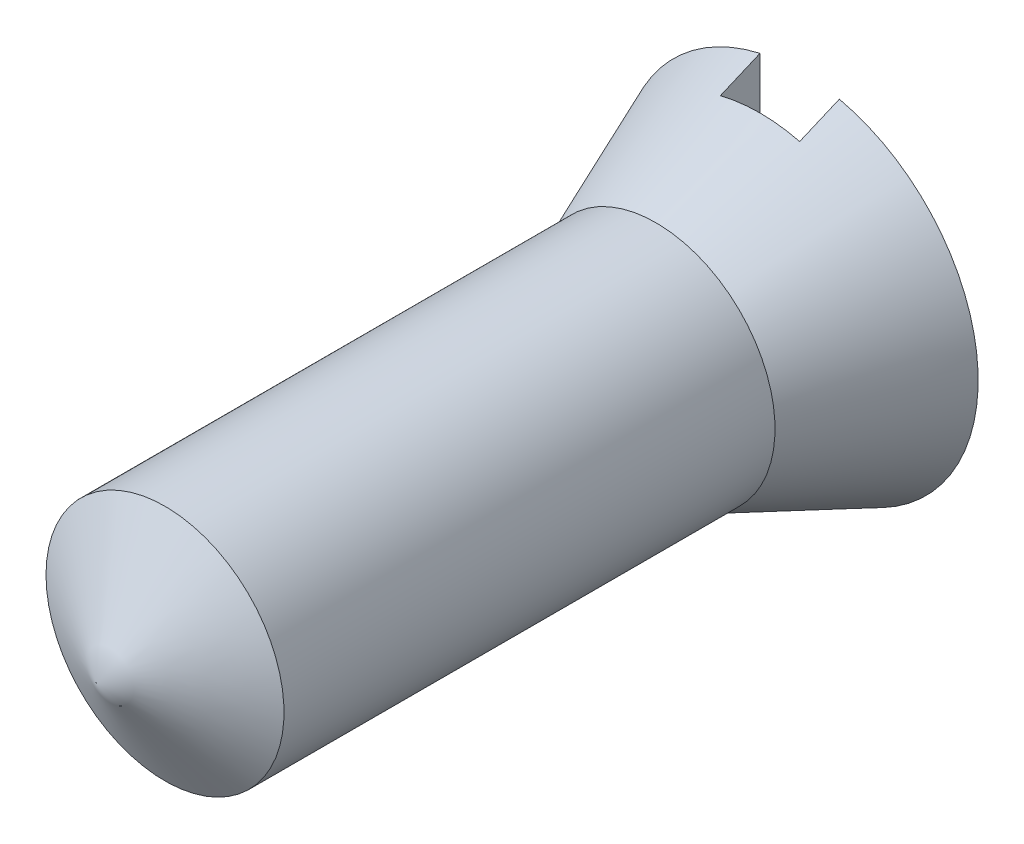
from build123d import *

# Parameters (mm, degrees)
SKETCH2_W          = 2
SKETCH2_H          = 10.452840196
CUT_EXTRUDE1_DEPTH = 1


with BuildPart() as part:
    # Sketch1 → Revolve1 (revolve)
    with BuildSketch(Plane(origin=(0, 0, 0), x_dir=(1, 0, 0), z_dir=(0, 1, 0)), mode=Mode.PRIVATE) as revolve1_sk:
        Polygon((0, 0), (0, 17.732050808), (4.5, 17.732050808), (3, 14.110730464), (3, 1.732050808), align=None)
    revolve(revolve1_sk.sketch.rotate(Axis((0, 0, 0), (0, 0, 1)), 180), axis=Axis((0, 0, 0), (0, 0, 1)))

    # Sketch2 → Cut-Extrude1 (cut)
    with BuildSketch(Plane(origin=(0, 0, -17.732050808), x_dir=(-1, 0, 0), z_dir=(0, 0, -1))):
        Rectangle(SKETCH2_W, SKETCH2_H)
    extrude(amount=-CUT_EXTRUDE1_DEPTH, mode=Mode.SUBTRACT)


solid = part.part
